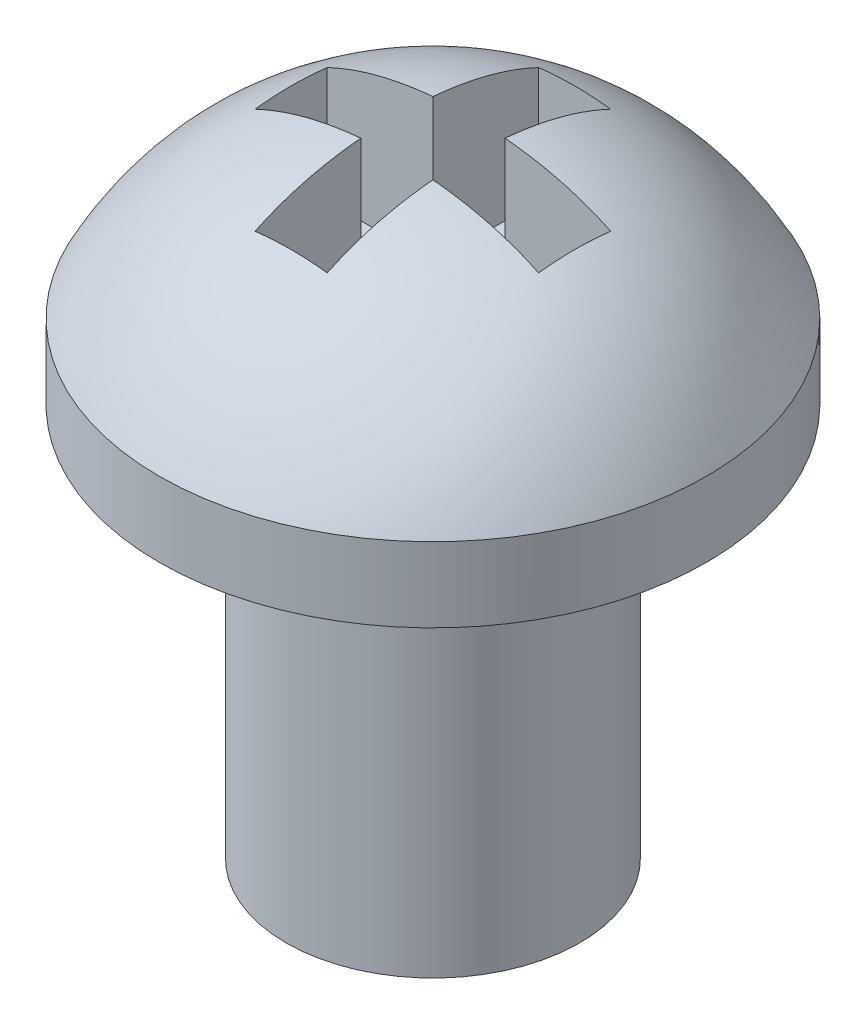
ISO-10303-21;
HEADER;
FILE_DESCRIPTION(('STEP AP214'),'2;1');
FILE_NAME('part.step','',(''),(''),'','','');
FILE_SCHEMA(('AUTOMOTIVE_DESIGN { 1 0 10303 214 1 1 1 1 }'));
ENDSEC;
DATA;
#1=APPLICATION_CONTEXT('core data for automotive mechanical design processes');
#2=APPLICATION_PROTOCOL_DEFINITION('international standard','automotive_design',2000,#1);
#3=PRODUCT_CONTEXT('',#1,'mechanical');
#4=PRODUCT('Part','Part','',(#3));
#5=PRODUCT_RELATED_PRODUCT_CATEGORY('part','',(#4));
#6=PRODUCT_DEFINITION_FORMATION('','',#4);
#7=PRODUCT_DEFINITION_CONTEXT('part definition',#1,'design');
#8=PRODUCT_DEFINITION('design','',#6,#7);
#9=PRODUCT_DEFINITION_SHAPE('','',#8);
#10=(LENGTH_UNIT() NAMED_UNIT(*) SI_UNIT(.MILLI.,.METRE.));
#11=(NAMED_UNIT(*) PLANE_ANGLE_UNIT() SI_UNIT($,.RADIAN.));
#12=(NAMED_UNIT(*) SI_UNIT($,.STERADIAN.) SOLID_ANGLE_UNIT());
#13=UNCERTAINTY_MEASURE_WITH_UNIT(LENGTH_MEASURE(1.E-05),#10,'distance_accuracy_value','');
#14=(GEOMETRIC_REPRESENTATION_CONTEXT(3) GLOBAL_UNCERTAINTY_ASSIGNED_CONTEXT((#13)) GLOBAL_UNIT_ASSIGNED_CONTEXT((#10,
#11,#12)) REPRESENTATION_CONTEXT('',''));
#15=CARTESIAN_POINT('',(0.,0.,0.));
#16=DIRECTION('',(0.,0.,1.));
#17=DIRECTION('',(1.,0.,0.));
#18=AXIS2_PLACEMENT_3D('',#15,#16,#17);
#19=CARTESIAN_POINT('',(0.,0.889,0.));
#20=DIRECTION('',(0.,1.,0.));
#21=DIRECTION('',(0.,0.,1.));
#22=AXIS2_PLACEMENT_3D('',#19,#20,#21);
#23=PLANE('',#22);
#24=DIRECTION('',(-1.,0.,0.));
#25=VECTOR('',#24,1.);
#26=CARTESIAN_POINT('',(0.3683,0.889,-1.4478));
#27=LINE('',#26,#25);
#28=CARTESIAN_POINT('',(0.3683,0.889,-1.4478));
#29=VERTEX_POINT('',#28);
#30=CARTESIAN_POINT('',(-0.3683,0.889,-1.4478));
#31=VERTEX_POINT('',#30);
#32=EDGE_CURVE('E122',#29,#31,#27,.T.);
#33=ORIENTED_EDGE('',*,*,#32,.T.);
#34=DIRECTION('',(0.,0.,1.));
#35=VECTOR('',#34,1.);
#36=CARTESIAN_POINT('',(-0.3683,0.889,-1.4478));
#37=LINE('',#36,#35);
#38=CARTESIAN_POINT('',(-0.3683,0.889,-0.3683));
#39=VERTEX_POINT('',#38);
#40=EDGE_CURVE('E91',#31,#39,#37,.T.);
#41=ORIENTED_EDGE('',*,*,#40,.T.);
#42=DIRECTION('',(-1.,0.,0.));
#43=VECTOR('',#42,1.);
#44=CARTESIAN_POINT('',(-0.3683,0.889,-0.3683));
#45=LINE('',#44,#43);
#46=CARTESIAN_POINT('',(-1.4478,0.889,-0.3683));
#47=VERTEX_POINT('',#46);
#48=EDGE_CURVE('E237',#39,#47,#45,.T.);
#49=ORIENTED_EDGE('',*,*,#48,.T.);
#50=DIRECTION('',(0.,0.,1.));
#51=VECTOR('',#50,1.);
#52=CARTESIAN_POINT('',(-1.4478,0.889,-0.3683));
#53=LINE('',#52,#51);
#54=CARTESIAN_POINT('',(-1.4478,0.889,0.3683));
#55=VERTEX_POINT('',#54);
#56=EDGE_CURVE('E145',#47,#55,#53,.T.);
#57=ORIENTED_EDGE('',*,*,#56,.T.);
#58=DIRECTION('',(1.,0.,0.));
#59=VECTOR('',#58,1.);
#60=CARTESIAN_POINT('',(-1.4478,0.889,0.3683));
#61=LINE('',#60,#59);
#62=CARTESIAN_POINT('',(-0.3683,0.889,0.3683));
#63=VERTEX_POINT('',#62);
#64=EDGE_CURVE('E151',#55,#63,#61,.T.);
#65=ORIENTED_EDGE('',*,*,#64,.T.);
#66=DIRECTION('',(0.,0.,1.));
#67=VECTOR('',#66,1.);
#68=CARTESIAN_POINT('',(-0.3683,0.889,0.3683));
#69=LINE('',#68,#67);
#70=CARTESIAN_POINT('',(-0.3683,0.889,1.4478));
#71=VERTEX_POINT('',#70);
#72=EDGE_CURVE('E156',#63,#71,#69,.T.);
#73=ORIENTED_EDGE('',*,*,#72,.T.);
#74=DIRECTION('',(1.,0.,0.));
#75=VECTOR('',#74,1.);
#76=CARTESIAN_POINT('',(-0.3683,0.889,1.4478));
#77=LINE('',#76,#75);
#78=CARTESIAN_POINT('',(0.3683,0.889,1.4478));
#79=VERTEX_POINT('',#78);
#80=EDGE_CURVE('E135',#71,#79,#77,.T.);
#81=ORIENTED_EDGE('',*,*,#80,.T.);
#82=DIRECTION('',(0.,0.,-1.));
#83=VECTOR('',#82,1.);
#84=CARTESIAN_POINT('',(0.3683,0.889,1.4478));
#85=LINE('',#84,#83);
#86=CARTESIAN_POINT('',(0.3683,0.889,0.3683));
#87=VERTEX_POINT('',#86);
#88=EDGE_CURVE('E162',#79,#87,#85,.T.);
#89=ORIENTED_EDGE('',*,*,#88,.T.);
#90=DIRECTION('',(1.,0.,0.));
#91=VECTOR('',#90,1.);
#92=CARTESIAN_POINT('',(0.3683,0.889,0.3683));
#93=LINE('',#92,#91);
#94=CARTESIAN_POINT('',(1.4478,0.889,0.3683));
#95=VERTEX_POINT('',#94);
#96=EDGE_CURVE('E169',#87,#95,#93,.T.);
#97=ORIENTED_EDGE('',*,*,#96,.T.);
#98=DIRECTION('',(0.,0.,-1.));
#99=VECTOR('',#98,1.);
#100=CARTESIAN_POINT('',(1.4478,0.889,0.3683));
#101=LINE('',#100,#99);
#102=CARTESIAN_POINT('',(1.4478,0.889,-0.3683));
#103=VERTEX_POINT('',#102);
#104=EDGE_CURVE('E174',#95,#103,#101,.T.);
#105=ORIENTED_EDGE('',*,*,#104,.T.);
#106=DIRECTION('',(-1.,0.,0.));
#107=VECTOR('',#106,1.);
#108=CARTESIAN_POINT('',(1.4478,0.889,-0.3683));
#109=LINE('',#108,#107);
#110=CARTESIAN_POINT('',(0.3683,0.889,-0.3683));
#111=VERTEX_POINT('',#110);
#112=EDGE_CURVE('E125',#103,#111,#109,.T.);
#113=ORIENTED_EDGE('',*,*,#112,.T.);
#114=DIRECTION('',(0.,0.,-1.));
#115=VECTOR('',#114,1.);
#116=CARTESIAN_POINT('',(0.3683,0.889,-0.3683));
#117=LINE('',#116,#115);
#118=EDGE_CURVE('E119',#111,#29,#117,.T.);
#119=ORIENTED_EDGE('',*,*,#118,.T.);
#120=EDGE_LOOP('',(#33,#41,#49,#57,#65,#73,#81,#89,#97,#105,#113,#119));
#121=FACE_BOUND('',#120,.T.);
#122=ADVANCED_FACE('F16',(#121),#23,.T.);
#123=CARTESIAN_POINT('',(0.3683,2.921,-0.3683));
#124=DIRECTION('',(1.,0.,0.));
#125=DIRECTION('',(0.,0.,-1.));
#126=AXIS2_PLACEMENT_3D('',#123,#124,#125);
#127=PLANE('',#126);
#128=DIRECTION('',(0.,1.,0.));
#129=VECTOR('',#128,1.);
#130=CARTESIAN_POINT('',(0.3683,2.921,-1.4478));
#131=LINE('',#130,#129);
#132=CARTESIAN_POINT('',(0.368299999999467,2.07264834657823,-1.44779999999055));
#133=VERTEX_POINT('',#132);
#134=EDGE_CURVE('E127',#133,#29,#131,.F.);
#135=ORIENTED_EDGE('',*,*,#134,.T.);
#136=ORIENTED_EDGE('',*,*,#118,.F.);
#137=DIRECTION('',(0.,1.,0.));
#138=VECTOR('',#137,1.);
#139=CARTESIAN_POINT('',(0.3683,2.921,-0.3683));
#140=LINE('',#139,#138);
#141=CARTESIAN_POINT('',(0.368300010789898,2.35562858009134,-0.3683));
#142=VERTEX_POINT('',#141);
#143=EDGE_CURVE('E75',#111,#142,#140,.T.);
#144=ORIENTED_EDGE('',*,*,#143,.T.);
#145=CARTESIAN_POINT('',(0.3683,2.0726118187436,-1.44787696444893));
#146=CARTESIAN_POINT('',(0.3683,2.09280651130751,-1.40533658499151));
#147=CARTESIAN_POINT('',(0.3683,2.11190026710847,-1.36227810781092));
#148=CARTESIAN_POINT('',(0.3683,2.14779770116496,-1.27553185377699));
#149=CARTESIAN_POINT('',(0.3683,2.16461496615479,-1.23184970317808));
#150=CARTESIAN_POINT('',(0.3683,2.1960628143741,-1.14389631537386));
#151=CARTESIAN_POINT('',(0.3683,2.2107015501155,-1.09962798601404));
#152=CARTESIAN_POINT('',(0.3683,2.2378948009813,-1.01053874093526));
#153=CARTESIAN_POINT('',(0.3683,2.25045279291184,-0.965718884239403));
#154=CARTESIAN_POINT('',(0.3683,2.27356879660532,-0.875599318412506));
#155=CARTESIAN_POINT('',(0.3683,2.28412812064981,-0.830299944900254));
#156=CARTESIAN_POINT('',(0.3683,2.30335185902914,-0.739197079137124));
#157=CARTESIAN_POINT('',(0.3683,2.31201201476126,-0.693392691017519));
#158=CARTESIAN_POINT('',(0.3683,2.32751957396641,-0.601294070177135));
#159=CARTESIAN_POINT('',(0.3683,2.33435969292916,-0.554998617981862));
#160=CARTESIAN_POINT('',(0.3683,2.34630000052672,-0.461927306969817));
#161=CARTESIAN_POINT('',(0.3683,2.35139052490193,-0.415150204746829));
#162=CARTESIAN_POINT('',(0.368300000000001,2.35562869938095,-0.368300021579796));
#163=B_SPLINE_CURVE_WITH_KNOTS('',3,(#145,#146,#147,#148,#149,#150,#151,#152,#153,#154,#155,
#156,#157,#158,#159,#160,#161,#162),.UNSPECIFIED.,.F.,.F.,(4,2,2,2,2,2,2,2,4),(0.,
0.141249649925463,0.281615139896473,0.421441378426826,0.561031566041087,0.7005297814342,
0.840337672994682,0.980696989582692,1.12181959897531),.UNSPECIFIED.);
#164=EDGE_CURVE('E19',#133,#142,#163,.T.);
#165=ORIENTED_EDGE('',*,*,#164,.F.);
#166=EDGE_LOOP('',(#135,#136,#144,#165));
#167=FACE_BOUND('',#166,.T.);
#168=ADVANCED_FACE('F128',(#167),#127,.F.);
#169=CARTESIAN_POINT('',(1.4478,2.921,-0.3683));
#170=DIRECTION('',(0.,0.,-1.));
#171=DIRECTION('',(-1.,0.,0.));
#172=AXIS2_PLACEMENT_3D('',#169,#170,#171);
#173=PLANE('',#172);
#174=ORIENTED_EDGE('',*,*,#143,.F.);
#175=ORIENTED_EDGE('',*,*,#112,.F.);
#176=DIRECTION('',(0.,1.,0.));
#177=VECTOR('',#176,1.);
#178=CARTESIAN_POINT('',(1.4478,2.921,-0.3683));
#179=LINE('',#178,#177);
#180=CARTESIAN_POINT('',(1.44779999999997,2.07264834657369,-0.368300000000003));
#181=VERTEX_POINT('',#180);
#182=EDGE_CURVE('E171',#103,#181,#179,.T.);
#183=ORIENTED_EDGE('',*,*,#182,.T.);
#184=CARTESIAN_POINT('',(0.368300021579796,2.35562869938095,-0.3683));
#185=CARTESIAN_POINT('',(0.415150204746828,2.35139052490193,-0.3683));
#186=CARTESIAN_POINT('',(0.461927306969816,2.34630000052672,-0.3683));
#187=CARTESIAN_POINT('',(0.554998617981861,2.33435969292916,-0.3683));
#188=CARTESIAN_POINT('',(0.601294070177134,2.32751957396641,-0.3683));
#189=CARTESIAN_POINT('',(0.693392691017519,2.31201201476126,-0.3683));
#190=CARTESIAN_POINT('',(0.739197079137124,2.30335185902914,-0.3683));
#191=CARTESIAN_POINT('',(0.830299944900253,2.28412812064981,-0.3683));
#192=CARTESIAN_POINT('',(0.875599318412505,2.27356879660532,-0.3683));
#193=CARTESIAN_POINT('',(0.965718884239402,2.25045279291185,-0.3683));
#194=CARTESIAN_POINT('',(1.01053874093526,2.2378948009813,-0.3683));
#195=CARTESIAN_POINT('',(1.09962798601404,2.2107015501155,-0.3683));
#196=CARTESIAN_POINT('',(1.14389631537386,2.1960628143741,-0.3683));
#197=CARTESIAN_POINT('',(1.23184970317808,2.16461496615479,-0.3683));
#198=CARTESIAN_POINT('',(1.27553185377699,2.14779770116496,-0.3683));
#199=CARTESIAN_POINT('',(1.36227810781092,2.11190026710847,-0.3683));
#200=CARTESIAN_POINT('',(1.40533658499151,2.09280651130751,-0.3683));
#201=CARTESIAN_POINT('',(1.44787696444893,2.0726118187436,-0.3683));
#202=B_SPLINE_CURVE_WITH_KNOTS('',3,(#184,#185,#186,#187,#188,#189,#190,#191,#192,#193,#194,
#195,#196,#197,#198,#199,#200,#201),.UNSPECIFIED.,.F.,.F.,(4,2,2,2,2,2,2,2,4),(0.,
0.141122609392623,0.281481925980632,0.421289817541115,0.560788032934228,0.700378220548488,
0.840204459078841,0.980569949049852,1.12181959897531),.UNSPECIFIED.);
#203=EDGE_CURVE('E360',#142,#181,#202,.T.);
#204=ORIENTED_EDGE('',*,*,#203,.F.);
#205=EDGE_LOOP('',(#174,#175,#183,#204));
#206=FACE_BOUND('',#205,.T.);
#207=ADVANCED_FACE('F365',(#206),#173,.F.);
#208=CARTESIAN_POINT('',(1.4478,2.921,0.3683));
#209=DIRECTION('',(1.,0.,0.));
#210=DIRECTION('',(0.,0.,-1.));
#211=AXIS2_PLACEMENT_3D('',#208,#209,#210);
#212=PLANE('',#211);
#213=ORIENTED_EDGE('',*,*,#182,.F.);
#214=ORIENTED_EDGE('',*,*,#104,.F.);
#215=DIRECTION('',(0.,1.,0.));
#216=VECTOR('',#215,1.);
#217=CARTESIAN_POINT('',(1.4478,2.921,0.3683));
#218=LINE('',#217,#216);
#219=CARTESIAN_POINT('',(1.44779999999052,2.07264834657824,0.36829999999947));
#220=VERTEX_POINT('',#219);
#221=EDGE_CURVE('E164',#95,#220,#218,.T.);
#222=ORIENTED_EDGE('',*,*,#221,.T.);
#223=CARTESIAN_POINT('',(1.4478,2.07264549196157,-0.368323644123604));
#224=CARTESIAN_POINT('',(1.4478,2.0775746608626,-0.327488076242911));
#225=CARTESIAN_POINT('',(1.4478,2.08167142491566,-0.286552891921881));
#226=CARTESIAN_POINT('',(1.4478,2.08820240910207,-0.20468079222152));
#227=CARTESIAN_POINT('',(1.4478,2.09064186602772,-0.163744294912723));
#228=CARTESIAN_POINT('',(1.4478,2.09388904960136,-0.0818717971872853));
#229=CARTESIAN_POINT('',(1.4478,2.09469935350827,-0.0409358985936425));
#230=CARTESIAN_POINT('',(1.4478,2.09469935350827,0.040935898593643));
#231=CARTESIAN_POINT('',(1.4478,2.09388904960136,0.0818717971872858));
#232=CARTESIAN_POINT('',(1.4478,2.09064186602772,0.163744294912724));
#233=CARTESIAN_POINT('',(1.4478,2.08820240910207,0.20468079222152));
#234=CARTESIAN_POINT('',(1.4478,2.08167142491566,0.286552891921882));
#235=CARTESIAN_POINT('',(1.4478,2.0775746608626,0.327488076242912));
#236=CARTESIAN_POINT('',(1.4478,2.07264549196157,0.368323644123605));
#237=B_SPLINE_CURVE_WITH_KNOTS('',3,(#223,#224,#225,#226,#227,#228,#229,#230,#231,#232,#233,
#234,#235,#236),.UNSPECIFIED.,.F.,.F.,(4,2,2,2,2,2,4),(0.,0.123386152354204,0.246380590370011,
0.369180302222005,0.491980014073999,0.614974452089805,0.738360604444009),.UNSPECIFIED.);
#238=EDGE_CURVE('E355',#181,#220,#237,.T.);
#239=ORIENTED_EDGE('',*,*,#238,.F.);
#240=EDGE_LOOP('',(#213,#214,#222,#239));
#241=FACE_BOUND('',#240,.T.);
#242=ADVANCED_FACE('F345',(#241),#212,.F.);
#243=CARTESIAN_POINT('',(0.3683,2.921,0.3683));
#244=DIRECTION('',(0.,0.,1.));
#245=DIRECTION('',(1.,0.,0.));
#246=AXIS2_PLACEMENT_3D('',#243,#244,#245);
#247=PLANE('',#246);
#248=ORIENTED_EDGE('',*,*,#221,.F.);
#249=ORIENTED_EDGE('',*,*,#96,.F.);
#250=DIRECTION('',(0.,1.,0.));
#251=VECTOR('',#250,1.);
#252=CARTESIAN_POINT('',(0.3683,2.921,0.3683));
#253=LINE('',#252,#251);
#254=CARTESIAN_POINT('',(0.3683,2.35562858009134,0.368300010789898));
#255=VERTEX_POINT('',#254);
#256=EDGE_CURVE('E130',#87,#255,#253,.T.);
#257=ORIENTED_EDGE('',*,*,#256,.T.);
#258=CARTESIAN_POINT('',(1.44787696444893,2.0726118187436,0.3683));
#259=CARTESIAN_POINT('',(1.40533658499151,2.09280651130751,0.3683));
#260=CARTESIAN_POINT('',(1.36227810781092,2.11190026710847,0.3683));
#261=CARTESIAN_POINT('',(1.27553185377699,2.14779770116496,0.3683));
#262=CARTESIAN_POINT('',(1.23184970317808,2.16461496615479,0.3683));
#263=CARTESIAN_POINT('',(1.14389631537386,2.1960628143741,0.3683));
#264=CARTESIAN_POINT('',(1.09962798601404,2.2107015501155,0.3683));
#265=CARTESIAN_POINT('',(1.01053874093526,2.2378948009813,0.3683));
#266=CARTESIAN_POINT('',(0.965718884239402,2.25045279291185,0.3683));
#267=CARTESIAN_POINT('',(0.875599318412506,2.27356879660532,0.3683));
#268=CARTESIAN_POINT('',(0.830299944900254,2.28412812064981,0.3683));
#269=CARTESIAN_POINT('',(0.739197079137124,2.30335185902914,0.3683));
#270=CARTESIAN_POINT('',(0.693392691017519,2.31201201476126,0.3683));
#271=CARTESIAN_POINT('',(0.601294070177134,2.32751957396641,0.3683));
#272=CARTESIAN_POINT('',(0.554998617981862,2.33435969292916,0.3683));
#273=CARTESIAN_POINT('',(0.461927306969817,2.34630000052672,0.3683));
#274=CARTESIAN_POINT('',(0.415150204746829,2.35139052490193,0.3683));
#275=CARTESIAN_POINT('',(0.368300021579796,2.35562869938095,0.3683));
#276=B_SPLINE_CURVE_WITH_KNOTS('',3,(#258,#259,#260,#261,#262,#263,#264,#265,#266,#267,#268,
#269,#270,#271,#272,#273,#274,#275),.UNSPECIFIED.,.F.,.F.,(4,2,2,2,2,2,2,2,4),(0.,
0.141249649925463,0.281615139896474,0.421441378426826,0.561031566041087,0.700529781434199,
0.840337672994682,0.980696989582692,1.12181959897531),.UNSPECIFIED.);
#277=EDGE_CURVE('E349',#220,#255,#276,.T.);
#278=ORIENTED_EDGE('',*,*,#277,.F.);
#279=EDGE_LOOP('',(#248,#249,#257,#278));
#280=FACE_BOUND('',#279,.T.);
#281=ADVANCED_FACE('F340',(#280),#247,.F.);
#282=CARTESIAN_POINT('',(0.3683,2.921,1.4478));
#283=DIRECTION('',(1.,0.,0.));
#284=DIRECTION('',(0.,0.,-1.));
#285=AXIS2_PLACEMENT_3D('',#282,#283,#284);
#286=PLANE('',#285);
#287=ORIENTED_EDGE('',*,*,#256,.F.);
#288=ORIENTED_EDGE('',*,*,#88,.F.);
#289=DIRECTION('',(0.,1.,0.));
#290=VECTOR('',#289,1.);
#291=CARTESIAN_POINT('',(0.3683,2.921,1.4478));
#292=LINE('',#291,#290);
#293=CARTESIAN_POINT('',(0.3683,2.07264834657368,1.4478));
#294=VERTEX_POINT('',#293);
#295=EDGE_CURVE('E137',#79,#294,#292,.T.);
#296=ORIENTED_EDGE('',*,*,#295,.T.);
#297=CARTESIAN_POINT('',(0.3683,2.35562869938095,0.368300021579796));
#298=CARTESIAN_POINT('',(0.3683,2.35139052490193,0.415150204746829));
#299=CARTESIAN_POINT('',(0.3683,2.34630000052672,0.461927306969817));
#300=CARTESIAN_POINT('',(0.3683,2.33435969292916,0.554998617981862));
#301=CARTESIAN_POINT('',(0.3683,2.32751957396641,0.601294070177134));
#302=CARTESIAN_POINT('',(0.3683,2.31201201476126,0.693392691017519));
#303=CARTESIAN_POINT('',(0.3683,2.30335185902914,0.739197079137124));
#304=CARTESIAN_POINT('',(0.3683,2.28412812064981,0.830299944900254));
#305=CARTESIAN_POINT('',(0.3683,2.27356879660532,0.875599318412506));
#306=CARTESIAN_POINT('',(0.3683,2.25045279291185,0.965718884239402));
#307=CARTESIAN_POINT('',(0.3683,2.2378948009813,1.01053874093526));
#308=CARTESIAN_POINT('',(0.3683,2.2107015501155,1.09962798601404));
#309=CARTESIAN_POINT('',(0.3683,2.1960628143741,1.14389631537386));
#310=CARTESIAN_POINT('',(0.3683,2.16461496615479,1.23184970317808));
#311=CARTESIAN_POINT('',(0.3683,2.14779770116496,1.27553185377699));
#312=CARTESIAN_POINT('',(0.3683,2.11190026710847,1.36227810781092));
#313=CARTESIAN_POINT('',(0.3683,2.09280651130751,1.40533658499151));
#314=CARTESIAN_POINT('',(0.368300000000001,2.0726118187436,1.44787696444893));
#315=B_SPLINE_CURVE_WITH_KNOTS('',3,(#297,#298,#299,#300,#301,#302,#303,#304,#305,#306,#307,
#308,#309,#310,#311,#312,#313,#314),.UNSPECIFIED.,.F.,.F.,(4,2,2,2,2,2,2,2,4),(0.,
0.141122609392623,0.281481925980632,0.421289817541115,0.560788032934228,0.700378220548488,
0.840204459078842,0.980569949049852,1.12181959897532),.UNSPECIFIED.);
#316=EDGE_CURVE('E323',#255,#294,#315,.T.);
#317=ORIENTED_EDGE('',*,*,#316,.F.);
#318=EDGE_LOOP('',(#287,#288,#296,#317));
#319=FACE_BOUND('',#318,.T.);
#320=ADVANCED_FACE('F336',(#319),#286,.F.);
#321=CARTESIAN_POINT('',(0.3683,2.921,-1.4478));
#322=DIRECTION('',(0.,0.,-1.));
#323=DIRECTION('',(-1.,0.,0.));
#324=AXIS2_PLACEMENT_3D('',#321,#322,#323);
#325=PLANE('',#324);
#326=ORIENTED_EDGE('',*,*,#134,.F.);
#327=CARTESIAN_POINT('',(-0.368323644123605,2.07264549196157,-1.4478));
#328=CARTESIAN_POINT('',(-0.307121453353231,2.08002881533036,-1.44780000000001));
#329=CARTESIAN_POINT('',(-0.245697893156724,2.08554880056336,-1.4478));
#330=CARTESIAN_POINT('',(-0.122849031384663,2.09287749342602,-1.4478));
#331=CARTESIAN_POINT('',(-0.0614245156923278,2.09469935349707,-1.44779999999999));
#332=CARTESIAN_POINT('',(0.0614245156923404,2.09469935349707,-1.44779999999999));
#333=CARTESIAN_POINT('',(0.122849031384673,2.09287749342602,-1.4478));
#334=CARTESIAN_POINT('',(0.245697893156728,2.08554880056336,-1.4478));
#335=CARTESIAN_POINT('',(0.307121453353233,2.08002881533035,-1.44780000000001));
#336=CARTESIAN_POINT('',(0.368323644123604,2.07264549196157,-1.4478));
#337=B_SPLINE_CURVE_WITH_KNOTS('',3,(#327,#328,#329,#330,#331,#332,#333,#334,#335,#336),
.UNSPECIFIED.,.F.,.F.,(4,2,2,2,4),(0.,0.184904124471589,0.36914947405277,0.553394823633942,
0.738298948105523),.UNSPECIFIED.);
#338=CARTESIAN_POINT('',(-0.3683,2.07264834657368,-1.4478));
#339=VERTEX_POINT('',#338);
#340=EDGE_CURVE('E82',#339,#133,#337,.T.);
#341=ORIENTED_EDGE('',*,*,#340,.F.);
#342=DIRECTION('',(0.,1.,0.));
#343=VECTOR('',#342,1.);
#344=CARTESIAN_POINT('',(-0.3683,2.921,-1.4478));
#345=LINE('',#344,#343);
#346=EDGE_CURVE('E134',#339,#31,#345,.F.);
#347=ORIENTED_EDGE('',*,*,#346,.T.);
#348=ORIENTED_EDGE('',*,*,#32,.F.);
#349=EDGE_LOOP('',(#326,#341,#347,#348));
#350=FACE_BOUND('',#349,.T.);
#351=ADVANCED_FACE('F132',(#350),#325,.F.);
#352=CARTESIAN_POINT('',(-0.3683,2.921,1.4478));
#353=DIRECTION('',(0.,0.,1.));
#354=DIRECTION('',(1.,0.,0.));
#355=AXIS2_PLACEMENT_3D('',#352,#353,#354);
#356=PLANE('',#355);
#357=CARTESIAN_POINT('',(0.368323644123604,2.07264549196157,1.4478));
#358=CARTESIAN_POINT('',(0.307121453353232,2.08002881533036,1.4478));
#359=CARTESIAN_POINT('',(0.245697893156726,2.08554880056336,1.4478));
#360=CARTESIAN_POINT('',(0.122849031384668,2.09287749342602,1.4478));
#361=CARTESIAN_POINT('',(0.0614245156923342,2.09469935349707,1.4478));
#362=CARTESIAN_POINT('',(-0.0614245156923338,2.09469935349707,1.4478));
#363=CARTESIAN_POINT('',(-0.122849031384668,2.09287749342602,1.4478));
#364=CARTESIAN_POINT('',(-0.245697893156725,2.08554880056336,1.4478));
#365=CARTESIAN_POINT('',(-0.307121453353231,2.08002881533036,1.4478));
#366=CARTESIAN_POINT('',(-0.368323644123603,2.07264549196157,1.4478));
#367=B_SPLINE_CURVE_WITH_KNOTS('',3,(#357,#358,#359,#360,#361,#362,#363,#364,#365,#366),
.UNSPECIFIED.,.F.,.F.,(4,2,2,2,4),(0.,0.184904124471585,0.369149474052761,0.553394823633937,
0.738298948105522),.UNSPECIFIED.);
#368=CARTESIAN_POINT('',(-0.368299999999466,2.07264834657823,1.44779999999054));
#369=VERTEX_POINT('',#368);
#370=EDGE_CURVE('E315',#294,#369,#367,.T.);
#371=ORIENTED_EDGE('',*,*,#370,.F.);
#372=ORIENTED_EDGE('',*,*,#295,.F.);
#373=ORIENTED_EDGE('',*,*,#80,.F.);
#374=DIRECTION('',(0.,1.,0.));
#375=VECTOR('',#374,1.);
#376=CARTESIAN_POINT('',(-0.3683,2.921,1.4478));
#377=LINE('',#376,#375);
#378=EDGE_CURVE('E153',#71,#369,#377,.T.);
#379=ORIENTED_EDGE('',*,*,#378,.T.);
#380=EDGE_LOOP('',(#371,#372,#373,#379));
#381=FACE_BOUND('',#380,.T.);
#382=ADVANCED_FACE('F307',(#381),#356,.F.);
#383=CARTESIAN_POINT('',(-0.3683,2.921,0.3683));
#384=DIRECTION('',(-1.,0.,0.));
#385=DIRECTION('',(0.,0.,1.));
#386=AXIS2_PLACEMENT_3D('',#383,#384,#385);
#387=PLANE('',#386);
#388=ORIENTED_EDGE('',*,*,#378,.F.);
#389=ORIENTED_EDGE('',*,*,#72,.F.);
#390=DIRECTION('',(0.,1.,0.));
#391=VECTOR('',#390,1.);
#392=CARTESIAN_POINT('',(-0.3683,2.921,0.3683));
#393=LINE('',#392,#391);
#394=CARTESIAN_POINT('',(-0.368300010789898,2.35562858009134,0.3683));
#395=VERTEX_POINT('',#394);
#396=EDGE_CURVE('E148',#63,#395,#393,.T.);
#397=ORIENTED_EDGE('',*,*,#396,.T.);
#398=CARTESIAN_POINT('',(-0.3683,2.0726118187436,1.44787696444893));
#399=CARTESIAN_POINT('',(-0.3683,2.09280651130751,1.40533658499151));
#400=CARTESIAN_POINT('',(-0.3683,2.11190026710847,1.36227810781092));
#401=CARTESIAN_POINT('',(-0.3683,2.14779770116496,1.27553185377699));
#402=CARTESIAN_POINT('',(-0.3683,2.16461496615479,1.23184970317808));
#403=CARTESIAN_POINT('',(-0.3683,2.1960628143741,1.14389631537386));
#404=CARTESIAN_POINT('',(-0.3683,2.2107015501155,1.09962798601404));
#405=CARTESIAN_POINT('',(-0.3683,2.2378948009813,1.01053874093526));
#406=CARTESIAN_POINT('',(-0.3683,2.25045279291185,0.965718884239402));
#407=CARTESIAN_POINT('',(-0.3683,2.27356879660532,0.875599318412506));
#408=CARTESIAN_POINT('',(-0.3683,2.28412812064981,0.830299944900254));
#409=CARTESIAN_POINT('',(-0.3683,2.30335185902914,0.739197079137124));
#410=CARTESIAN_POINT('',(-0.3683,2.31201201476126,0.693392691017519));
#411=CARTESIAN_POINT('',(-0.3683,2.32751957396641,0.601294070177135));
#412=CARTESIAN_POINT('',(-0.3683,2.33435969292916,0.554998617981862));
#413=CARTESIAN_POINT('',(-0.3683,2.34630000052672,0.461927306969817));
#414=CARTESIAN_POINT('',(-0.3683,2.35139052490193,0.415150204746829));
#415=CARTESIAN_POINT('',(-0.3683,2.35562869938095,0.368300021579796));
#416=B_SPLINE_CURVE_WITH_KNOTS('',3,(#398,#399,#400,#401,#402,#403,#404,#405,#406,#407,#408,
#409,#410,#411,#412,#413,#414,#415),.UNSPECIFIED.,.F.,.F.,(4,2,2,2,2,2,2,2,4),(0.,
0.141249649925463,0.281615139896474,0.421441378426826,0.561031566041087,0.700529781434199,
0.840337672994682,0.980696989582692,1.12181959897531),.UNSPECIFIED.);
#417=EDGE_CURVE('E284',#369,#395,#416,.T.);
#418=ORIENTED_EDGE('',*,*,#417,.F.);
#419=EDGE_LOOP('',(#388,#389,#397,#418));
#420=FACE_BOUND('',#419,.T.);
#421=ADVANCED_FACE('F302',(#420),#387,.F.);
#422=CARTESIAN_POINT('',(-1.4478,2.921,0.3683));
#423=DIRECTION('',(0.,0.,1.));
#424=DIRECTION('',(1.,0.,0.));
#425=AXIS2_PLACEMENT_3D('',#422,#423,#424);
#426=PLANE('',#425);
#427=ORIENTED_EDGE('',*,*,#396,.F.);
#428=ORIENTED_EDGE('',*,*,#64,.F.);
#429=DIRECTION('',(0.,1.,0.));
#430=VECTOR('',#429,1.);
#431=CARTESIAN_POINT('',(-1.4478,2.921,0.3683));
#432=LINE('',#431,#430);
#433=CARTESIAN_POINT('',(-1.44779999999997,2.07264834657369,0.368300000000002));
#434=VERTEX_POINT('',#433);
#435=EDGE_CURVE('E147',#55,#434,#432,.T.);
#436=ORIENTED_EDGE('',*,*,#435,.T.);
#437=CARTESIAN_POINT('',(-0.368300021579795,2.35562869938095,0.3683));
#438=CARTESIAN_POINT('',(-0.415150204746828,2.35139052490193,0.3683));
#439=CARTESIAN_POINT('',(-0.461927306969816,2.34630000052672,0.3683));
#440=CARTESIAN_POINT('',(-0.554998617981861,2.33435969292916,0.3683));
#441=CARTESIAN_POINT('',(-0.601294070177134,2.32751957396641,0.3683));
#442=CARTESIAN_POINT('',(-0.693392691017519,2.31201201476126,0.3683));
#443=CARTESIAN_POINT('',(-0.739197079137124,2.30335185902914,0.3683));
#444=CARTESIAN_POINT('',(-0.830299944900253,2.28412812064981,0.3683));
#445=CARTESIAN_POINT('',(-0.875599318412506,2.27356879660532,0.3683));
#446=CARTESIAN_POINT('',(-0.965718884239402,2.25045279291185,0.3683));
#447=CARTESIAN_POINT('',(-1.01053874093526,2.2378948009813,0.3683));
#448=CARTESIAN_POINT('',(-1.09962798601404,2.2107015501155,0.3683));
#449=CARTESIAN_POINT('',(-1.14389631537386,2.1960628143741,0.3683));
#450=CARTESIAN_POINT('',(-1.23184970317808,2.16461496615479,0.3683));
#451=CARTESIAN_POINT('',(-1.27553185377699,2.14779770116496,0.3683));
#452=CARTESIAN_POINT('',(-1.36227810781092,2.11190026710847,0.3683));
#453=CARTESIAN_POINT('',(-1.40533658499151,2.09280651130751,0.3683));
#454=CARTESIAN_POINT('',(-1.44787696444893,2.0726118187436,0.3683));
#455=B_SPLINE_CURVE_WITH_KNOTS('',3,(#437,#438,#439,#440,#441,#442,#443,#444,#445,#446,#447,
#448,#449,#450,#451,#452,#453,#454),.UNSPECIFIED.,.F.,.F.,(4,2,2,2,2,2,2,2,4),(0.,
0.141122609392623,0.281481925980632,0.421289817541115,0.560788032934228,0.700378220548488,
0.840204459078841,0.980569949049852,1.12181959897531),.UNSPECIFIED.);
#456=EDGE_CURVE('E283',#395,#434,#455,.T.);
#457=ORIENTED_EDGE('',*,*,#456,.F.);
#458=EDGE_LOOP('',(#427,#428,#436,#457));
#459=FACE_BOUND('',#458,.T.);
#460=ADVANCED_FACE('F297',(#459),#426,.F.);
#461=CARTESIAN_POINT('',(-1.4478,2.921,-0.3683));
#462=DIRECTION('',(-1.,0.,0.));
#463=DIRECTION('',(0.,0.,1.));
#464=AXIS2_PLACEMENT_3D('',#461,#462,#463);
#465=PLANE('',#464);
#466=ORIENTED_EDGE('',*,*,#435,.F.);
#467=ORIENTED_EDGE('',*,*,#56,.F.);
#468=DIRECTION('',(0.,1.,0.));
#469=VECTOR('',#468,1.);
#470=CARTESIAN_POINT('',(-1.4478,2.921,-0.3683));
#471=LINE('',#470,#469);
#472=CARTESIAN_POINT('',(-1.44779999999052,2.07264834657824,-0.368299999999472));
#473=VERTEX_POINT('',#472);
#474=EDGE_CURVE('E233',#47,#473,#471,.T.);
#475=ORIENTED_EDGE('',*,*,#474,.T.);
#476=CARTESIAN_POINT('',(-1.4478,2.07264549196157,0.368323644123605));
#477=CARTESIAN_POINT('',(-1.4478,2.0775746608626,0.327488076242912));
#478=CARTESIAN_POINT('',(-1.4478,2.08167142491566,0.286552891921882));
#479=CARTESIAN_POINT('',(-1.4478,2.08820240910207,0.204680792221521));
#480=CARTESIAN_POINT('',(-1.4478,2.09064186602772,0.163744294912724));
#481=CARTESIAN_POINT('',(-1.4478,2.09388904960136,0.0818717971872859));
#482=CARTESIAN_POINT('',(-1.4478,2.09469935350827,0.0409358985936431));
#483=CARTESIAN_POINT('',(-1.4478,2.09469935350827,-0.0409358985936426));
#484=CARTESIAN_POINT('',(-1.4478,2.09388904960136,-0.0818717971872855));
#485=CARTESIAN_POINT('',(-1.4478,2.09064186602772,-0.163744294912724));
#486=CARTESIAN_POINT('',(-1.4478,2.08820240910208,-0.20468079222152));
#487=CARTESIAN_POINT('',(-1.4478,2.08167142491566,-0.286552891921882));
#488=CARTESIAN_POINT('',(-1.4478,2.0775746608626,-0.327488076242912));
#489=CARTESIAN_POINT('',(-1.4478,2.07264549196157,-0.368323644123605));
#490=B_SPLINE_CURVE_WITH_KNOTS('',3,(#476,#477,#478,#479,#480,#481,#482,#483,#484,#485,#486,
#487,#488,#489),.UNSPECIFIED.,.F.,.F.,(4,2,2,2,2,2,4),(0.,0.123386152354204,0.246380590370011,
0.369180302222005,0.491980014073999,0.614974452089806,0.73836060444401),.UNSPECIFIED.);
#491=EDGE_CURVE('E279',#434,#473,#490,.T.);
#492=ORIENTED_EDGE('',*,*,#491,.F.);
#493=EDGE_LOOP('',(#466,#467,#475,#492));
#494=FACE_BOUND('',#493,.T.);
#495=ADVANCED_FACE('F274',(#494),#465,.F.);
#496=CARTESIAN_POINT('',(-0.3683,2.921,-0.3683));
#497=DIRECTION('',(0.,0.,-1.));
#498=DIRECTION('',(-1.,0.,0.));
#499=AXIS2_PLACEMENT_3D('',#496,#497,#498);
#500=PLANE('',#499);
#501=ORIENTED_EDGE('',*,*,#474,.F.);
#502=ORIENTED_EDGE('',*,*,#48,.F.);
#503=DIRECTION('',(0.,1.,0.));
#504=VECTOR('',#503,1.);
#505=CARTESIAN_POINT('',(-0.3683,2.921,-0.3683));
#506=LINE('',#505,#504);
#507=CARTESIAN_POINT('',(-0.3683,2.35562858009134,-0.368300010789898));
#508=VERTEX_POINT('',#507);
#509=EDGE_CURVE('E38',#39,#508,#506,.T.);
#510=ORIENTED_EDGE('',*,*,#509,.T.);
#511=CARTESIAN_POINT('',(-1.44787696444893,2.0726118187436,-0.368299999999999));
#512=CARTESIAN_POINT('',(-1.40533658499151,2.09280651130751,-0.3683));
#513=CARTESIAN_POINT('',(-1.36227810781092,2.11190026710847,-0.3683));
#514=CARTESIAN_POINT('',(-1.27553185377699,2.14779770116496,-0.3683));
#515=CARTESIAN_POINT('',(-1.23184970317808,2.16461496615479,-0.3683));
#516=CARTESIAN_POINT('',(-1.14389631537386,2.1960628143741,-0.3683));
#517=CARTESIAN_POINT('',(-1.09962798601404,2.2107015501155,-0.3683));
#518=CARTESIAN_POINT('',(-1.01053874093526,2.2378948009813,-0.3683));
#519=CARTESIAN_POINT('',(-0.965718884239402,2.25045279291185,-0.3683));
#520=CARTESIAN_POINT('',(-0.875599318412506,2.27356879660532,-0.3683));
#521=CARTESIAN_POINT('',(-0.830299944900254,2.28412812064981,-0.3683));
#522=CARTESIAN_POINT('',(-0.739197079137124,2.30335185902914,-0.3683));
#523=CARTESIAN_POINT('',(-0.693392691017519,2.31201201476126,-0.3683));
#524=CARTESIAN_POINT('',(-0.601294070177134,2.32751957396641,-0.3683));
#525=CARTESIAN_POINT('',(-0.554998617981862,2.33435969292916,-0.3683));
#526=CARTESIAN_POINT('',(-0.461927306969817,2.34630000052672,-0.3683));
#527=CARTESIAN_POINT('',(-0.415150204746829,2.35139052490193,-0.3683));
#528=CARTESIAN_POINT('',(-0.368300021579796,2.35562869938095,-0.3683));
#529=B_SPLINE_CURVE_WITH_KNOTS('',3,(#511,#512,#513,#514,#515,#516,#517,#518,#519,#520,#521,
#522,#523,#524,#525,#526,#527,#528),.UNSPECIFIED.,.F.,.F.,(4,2,2,2,2,2,2,2,4),(0.,
0.141249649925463,0.281615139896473,0.421441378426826,0.561031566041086,0.700529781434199,
0.840337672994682,0.980696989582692,1.12181959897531),.UNSPECIFIED.);
#530=EDGE_CURVE('E194',#473,#508,#529,.T.);
#531=ORIENTED_EDGE('',*,*,#530,.F.);
#532=EDGE_LOOP('',(#501,#502,#510,#531));
#533=FACE_BOUND('',#532,.T.);
#534=ADVANCED_FACE('F276',(#533),#500,.F.);
#535=CARTESIAN_POINT('',(-0.3683,2.921,-1.4478));
#536=DIRECTION('',(-1.,0.,0.));
#537=DIRECTION('',(0.,0.,1.));
#538=AXIS2_PLACEMENT_3D('',#535,#536,#537);
#539=PLANE('',#538);
#540=ORIENTED_EDGE('',*,*,#509,.F.);
#541=ORIENTED_EDGE('',*,*,#40,.F.);
#542=ORIENTED_EDGE('',*,*,#346,.F.);
#543=CARTESIAN_POINT('',(-0.3683,2.35562869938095,-0.368300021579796));
#544=CARTESIAN_POINT('',(-0.3683,2.35139052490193,-0.415150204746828));
#545=CARTESIAN_POINT('',(-0.3683,2.34630000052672,-0.461927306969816));
#546=CARTESIAN_POINT('',(-0.3683,2.33435969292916,-0.554998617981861));
#547=CARTESIAN_POINT('',(-0.3683,2.32751957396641,-0.601294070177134));
#548=CARTESIAN_POINT('',(-0.3683,2.31201201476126,-0.693392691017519));
#549=CARTESIAN_POINT('',(-0.3683,2.30335185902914,-0.739197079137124));
#550=CARTESIAN_POINT('',(-0.3683,2.28412812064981,-0.830299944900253));
#551=CARTESIAN_POINT('',(-0.3683,2.27356879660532,-0.875599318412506));
#552=CARTESIAN_POINT('',(-0.3683,2.25045279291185,-0.965718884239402));
#553=CARTESIAN_POINT('',(-0.3683,2.2378948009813,-1.01053874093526));
#554=CARTESIAN_POINT('',(-0.3683,2.2107015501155,-1.09962798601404));
#555=CARTESIAN_POINT('',(-0.3683,2.1960628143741,-1.14389631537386));
#556=CARTESIAN_POINT('',(-0.3683,2.16461496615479,-1.23184970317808));
#557=CARTESIAN_POINT('',(-0.3683,2.14779770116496,-1.27553185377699));
#558=CARTESIAN_POINT('',(-0.3683,2.11190026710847,-1.36227810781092));
#559=CARTESIAN_POINT('',(-0.3683,2.09280651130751,-1.40533658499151));
#560=CARTESIAN_POINT('',(-0.3683,2.0726118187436,-1.44787696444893));
#561=B_SPLINE_CURVE_WITH_KNOTS('',3,(#543,#544,#545,#546,#547,#548,#549,#550,#551,#552,#553,
#554,#555,#556,#557,#558,#559,#560),.UNSPECIFIED.,.F.,.F.,(4,2,2,2,2,2,2,2,4),(0.,
0.141122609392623,0.281481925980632,0.421289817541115,0.560788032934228,0.700378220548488,
0.840204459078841,0.980569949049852,1.12181959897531),.UNSPECIFIED.);
#562=EDGE_CURVE('E187',#508,#339,#561,.T.);
#563=ORIENTED_EDGE('',*,*,#562,.F.);
#564=EDGE_LOOP('',(#540,#541,#542,#563));
#565=FACE_BOUND('',#564,.T.);
#566=ADVANCED_FACE('F200',(#565),#539,.F.);
#567=CARTESIAN_POINT('',(0.,0.736086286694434,-2.8076188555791));
#568=CARTESIAN_POINT('',(0.,1.71319925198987,-2.29865617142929));
#569=CARTESIAN_POINT('',(0.,2.23587365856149,-1.51628594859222));
#570=CARTESIAN_POINT('',(0.,2.35901943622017,-0.49354409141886));
#571=(BOUNDED_CURVE() B_SPLINE_CURVE(3,(#567,#568,#569,#570),.UNSPECIFIED.,.F.,
.F.) B_SPLINE_CURVE_WITH_KNOTS((4,4),(0.,1.),
.UNSPECIFIED.) CURVE() GEOMETRIC_REPRESENTATION_ITEM() RATIONAL_B_SPLINE_CURVE((1.,1.,1.,1.)) REPRESENTATION_ITEM(''));
#572=CARTESIAN_POINT('',(0.,-9.8503388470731,0.));
#573=DIRECTION('',(0.,-1.,0.));
#574=AXIS1_PLACEMENT('',#572,#573);
#575=SURFACE_OF_REVOLUTION('',#571,#574);
#576=CARTESIAN_POINT('',(0.,0.762000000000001,0.));
#577=DIRECTION('',(0.,1.,0.));
#578=DIRECTION('',(0.,0.,1.));
#579=AXIS2_PLACEMENT_3D('',#576,#577,#578);
#580=CIRCLE('',#579,2.794);
#581=CARTESIAN_POINT('',(0.,0.762000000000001,2.794));
#582=VERTEX_POINT('',#581);
#583=EDGE_CURVE('E186',#582,#582,#580,.F.);
#584=ORIENTED_EDGE('',*,*,#583,.F.);
#585=EDGE_LOOP('',(#584));
#586=FACE_BOUND('',#585,.T.);
#587=ORIENTED_EDGE('',*,*,#530,.T.);
#588=ORIENTED_EDGE('',*,*,#562,.T.);
#589=ORIENTED_EDGE('',*,*,#340,.T.);
#590=ORIENTED_EDGE('',*,*,#164,.T.);
#591=ORIENTED_EDGE('',*,*,#203,.T.);
#592=ORIENTED_EDGE('',*,*,#238,.T.);
#593=ORIENTED_EDGE('',*,*,#277,.T.);
#594=ORIENTED_EDGE('',*,*,#316,.T.);
#595=ORIENTED_EDGE('',*,*,#370,.T.);
#596=ORIENTED_EDGE('',*,*,#417,.T.);
#597=ORIENTED_EDGE('',*,*,#456,.T.);
#598=ORIENTED_EDGE('',*,*,#491,.T.);
#599=EDGE_LOOP('',(#587,#588,#589,#590,#591,#592,#593,#594,#595,#596,#597,#598));
#600=FACE_BOUND('',#599,.T.);
#601=ADVANCED_FACE('F202',(#586,#600),#575,.F.);
#602=CARTESIAN_POINT('',(0.,-9.8503388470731,0.));
#603=DIRECTION('',(0.,1.,0.));
#604=DIRECTION('',(0.,0.,1.));
#605=AXIS2_PLACEMENT_3D('',#602,#603,#604);
#606=CYLINDRICAL_SURFACE('',#605,2.794);
#607=ORIENTED_EDGE('',*,*,#583,.T.);
#608=EDGE_LOOP('',(#607));
#609=FACE_BOUND('',#608,.T.);
#610=CARTESIAN_POINT('',(0.,0.,0.));
#611=DIRECTION('',(0.,1.,0.));
#612=DIRECTION('',(0.,0.,1.));
#613=AXIS2_PLACEMENT_3D('',#610,#611,#612);
#614=CIRCLE('',#613,2.794);
#615=CARTESIAN_POINT('',(0.,0.,2.794));
#616=VERTEX_POINT('',#615);
#617=EDGE_CURVE('E183',#616,#616,#614,.T.);
#618=ORIENTED_EDGE('',*,*,#617,.T.);
#619=EDGE_LOOP('',(#618));
#620=FACE_BOUND('',#619,.T.);
#621=ADVANCED_FACE('F207',(#609,#620),#606,.T.);
#622=CARTESIAN_POINT('',(0.,-4.0132,0.));
#623=DIRECTION('',(0.,1.,0.));
#624=DIRECTION('',(0.,0.,1.));
#625=AXIS2_PLACEMENT_3D('',#622,#623,#624);
#626=PLANE('',#625);
#627=CARTESIAN_POINT('',(0.,-4.0132,0.));
#628=DIRECTION('',(0.,1.,0.));
#629=DIRECTION('',(0.,0.,1.));
#630=AXIS2_PLACEMENT_3D('',#627,#628,#629);
#631=CIRCLE('',#630,1.4986);
#632=CARTESIAN_POINT('',(0.,-4.0132,1.4986));
#633=VERTEX_POINT('',#632);
#634=EDGE_CURVE('E29',#633,#633,#631,.T.);
#635=ORIENTED_EDGE('',*,*,#634,.F.);
#636=EDGE_LOOP('',(#635));
#637=FACE_BOUND('',#636,.T.);
#638=ADVANCED_FACE('F383',(#637),#626,.F.);
#639=CARTESIAN_POINT('',(0.,0.,0.));
#640=DIRECTION('',(0.,1.,0.));
#641=DIRECTION('',(0.,0.,1.));
#642=AXIS2_PLACEMENT_3D('',#639,#640,#641);
#643=PLANE('',#642);
#644=CARTESIAN_POINT('',(0.,0.,0.));
#645=DIRECTION('',(0.,1.,0.));
#646=DIRECTION('',(0.,0.,1.));
#647=AXIS2_PLACEMENT_3D('',#644,#645,#646);
#648=CIRCLE('',#647,1.4986);
#649=CARTESIAN_POINT('',(0.,0.,1.4986));
#650=VERTEX_POINT('',#649);
#651=EDGE_CURVE('E11',#650,#650,#648,.F.);
#652=ORIENTED_EDGE('',*,*,#651,.F.);
#653=EDGE_LOOP('',(#652));
#654=FACE_BOUND('',#653,.T.);
#655=ORIENTED_EDGE('',*,*,#617,.F.);
#656=EDGE_LOOP('',(#655));
#657=FACE_BOUND('',#656,.T.);
#658=ADVANCED_FACE('F377',(#654,#657),#643,.F.);
#659=CARTESIAN_POINT('',(0.,0.,0.));
#660=DIRECTION('',(0.,1.,0.));
#661=DIRECTION('',(0.,0.,1.));
#662=AXIS2_PLACEMENT_3D('',#659,#660,#661);
#663=CYLINDRICAL_SURFACE('',#662,1.4986);
#664=ORIENTED_EDGE('',*,*,#634,.T.);
#665=EDGE_LOOP('',(#664));
#666=FACE_BOUND('',#665,.T.);
#667=ORIENTED_EDGE('',*,*,#651,.T.);
#668=EDGE_LOOP('',(#667));
#669=FACE_BOUND('',#668,.T.);
#670=ADVANCED_FACE('F375',(#666,#669),#663,.T.);
#671=CLOSED_SHELL('',(#122,#168,#207,#242,#281,#320,#351,#382,#421,#460,#495,#534,#566,#601,
#621,#638,#658,#670));
#672=MANIFOLD_SOLID_BREP('B1',#671);
#673=ADVANCED_BREP_SHAPE_REPRESENTATION('',(#18,#672),#14);
#674=SHAPE_DEFINITION_REPRESENTATION(#9,#673);
ENDSEC;
END-ISO-10303-21;
